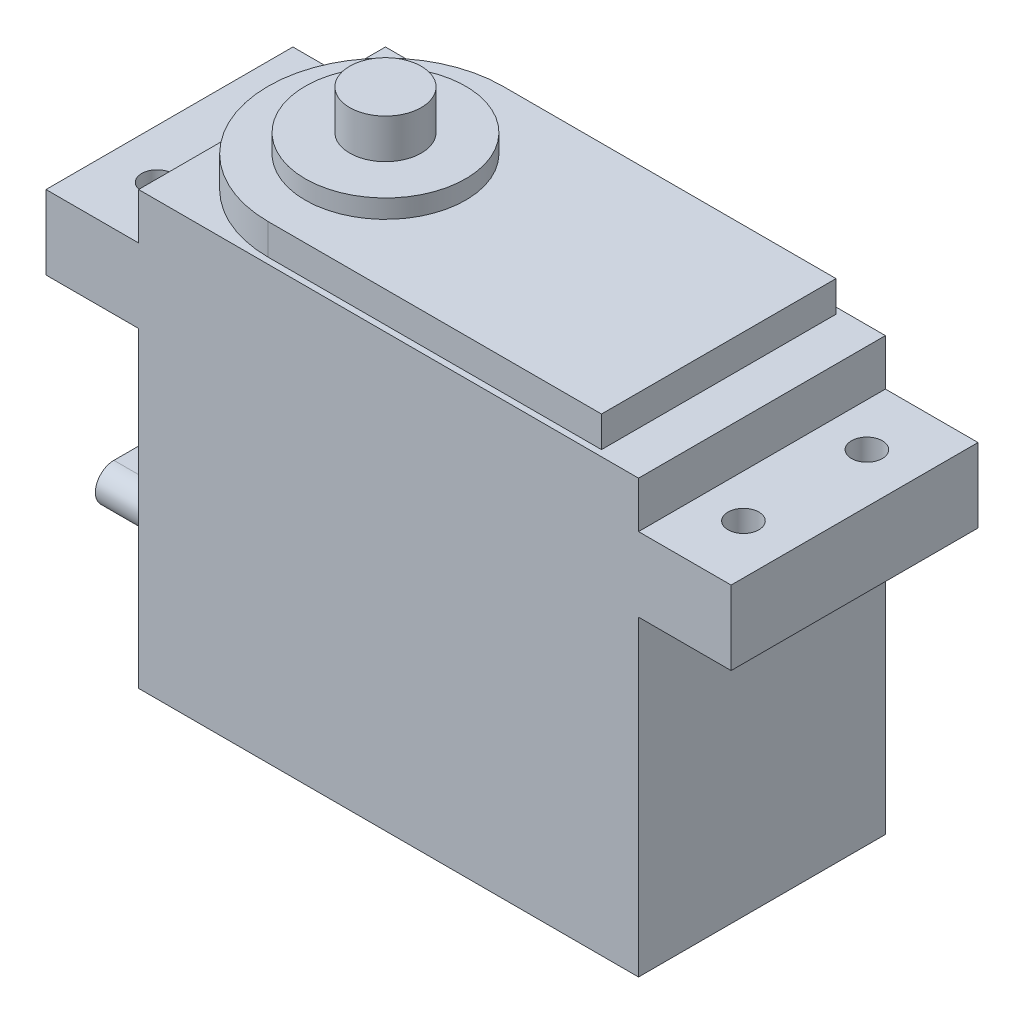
ISO-10303-21;
HEADER;
FILE_DESCRIPTION(('STEP AP214'),'2;1');
FILE_NAME('part.step','',(''),(''),'','','');
FILE_SCHEMA(('AUTOMOTIVE_DESIGN { 1 0 10303 214 1 1 1 1 }'));
ENDSEC;
DATA;
#1=APPLICATION_CONTEXT('core data for automotive mechanical design processes');
#2=APPLICATION_PROTOCOL_DEFINITION('international standard','automotive_design',2000,#1);
#3=PRODUCT_CONTEXT('',#1,'mechanical');
#4=PRODUCT('Part','Part','',(#3));
#5=PRODUCT_RELATED_PRODUCT_CATEGORY('part','',(#4));
#6=PRODUCT_DEFINITION_FORMATION('','',#4);
#7=PRODUCT_DEFINITION_CONTEXT('part definition',#1,'design');
#8=PRODUCT_DEFINITION('design','',#6,#7);
#9=PRODUCT_DEFINITION_SHAPE('','',#8);
#10=(LENGTH_UNIT() NAMED_UNIT(*) SI_UNIT(.MILLI.,.METRE.));
#11=(NAMED_UNIT(*) PLANE_ANGLE_UNIT() SI_UNIT($,.RADIAN.));
#12=(NAMED_UNIT(*) SI_UNIT($,.STERADIAN.) SOLID_ANGLE_UNIT());
#13=UNCERTAINTY_MEASURE_WITH_UNIT(LENGTH_MEASURE(1.E-05),#10,'distance_accuracy_value','');
#14=(GEOMETRIC_REPRESENTATION_CONTEXT(3) GLOBAL_UNCERTAINTY_ASSIGNED_CONTEXT((#13)) GLOBAL_UNIT_ASSIGNED_CONTEXT((#10,
#11,#12)) REPRESENTATION_CONTEXT('',''));
#15=CARTESIAN_POINT('',(0.,0.,0.));
#16=DIRECTION('',(0.,0.,1.));
#17=DIRECTION('',(1.,0.,0.));
#18=AXIS2_PLACEMENT_3D('',#15,#16,#17);
#19=CARTESIAN_POINT('',(-0.5,5.,8.50000000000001));
#20=DIRECTION('',(-1.,0.,0.));
#21=DIRECTION('',(0.,0.,1.));
#22=AXIS2_PLACEMENT_3D('',#19,#20,#21);
#23=PLANE('',#22);
#24=CARTESIAN_POINT('',(-0.5,5.,8.50000000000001));
#25=DIRECTION('',(-1.,0.,0.));
#26=DIRECTION('',(0.,0.,1.));
#27=AXIS2_PLACEMENT_3D('',#24,#25,#26);
#28=CIRCLE('',#27,2.);
#29=CARTESIAN_POINT('',(-0.5,7.,8.50000000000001));
#30=VERTEX_POINT('',#29);
#31=CARTESIAN_POINT('',(-0.5,3.,8.50000000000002));
#32=VERTEX_POINT('',#31);
#33=EDGE_CURVE('E229',#30,#32,#28,.T.);
#34=ORIENTED_EDGE('',*,*,#33,.T.);
#35=DIRECTION('',(0.,0.,1.));
#36=VECTOR('',#35,1.);
#37=CARTESIAN_POINT('',(-0.5,3.,11.5));
#38=LINE('',#37,#36);
#39=CARTESIAN_POINT('',(-0.5,3.,11.5));
#40=VERTEX_POINT('',#39);
#41=EDGE_CURVE('E232',#32,#40,#38,.T.);
#42=ORIENTED_EDGE('',*,*,#41,.T.);
#43=CARTESIAN_POINT('',(-0.5,5.,11.5));
#44=DIRECTION('',(-1.,0.,0.));
#45=DIRECTION('',(0.,0.,-1.));
#46=AXIS2_PLACEMENT_3D('',#43,#44,#45);
#47=CIRCLE('',#46,2.);
#48=CARTESIAN_POINT('',(-0.5,7.,11.5));
#49=VERTEX_POINT('',#48);
#50=EDGE_CURVE('E235',#40,#49,#47,.T.);
#51=ORIENTED_EDGE('',*,*,#50,.T.);
#52=DIRECTION('',(0.,0.,-1.));
#53=VECTOR('',#52,1.);
#54=CARTESIAN_POINT('',(-0.5,7.,8.50000000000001));
#55=LINE('',#54,#53);
#56=EDGE_CURVE('E237',#49,#30,#55,.T.);
#57=ORIENTED_EDGE('',*,*,#56,.T.);
#58=EDGE_LOOP('',(#34,#42,#51,#57));
#59=FACE_BOUND('',#58,.T.);
#60=DIRECTION('',(0.,0.,1.));
#61=VECTOR('',#60,1.);
#62=CARTESIAN_POINT('',(-0.5,3.5,8.50000000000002));
#63=LINE('',#62,#61);
#64=CARTESIAN_POINT('',(-0.5,3.5,8.50000000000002));
#65=VERTEX_POINT('',#64);
#66=CARTESIAN_POINT('',(-0.5,3.5,11.5));
#67=VERTEX_POINT('',#66);
#68=EDGE_CURVE('E798',#65,#67,#63,.T.);
#69=ORIENTED_EDGE('',*,*,#68,.F.);
#70=CARTESIAN_POINT('',(-0.5,5.,8.50000000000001));
#71=DIRECTION('',(-1.,0.,0.));
#72=DIRECTION('',(0.,0.,1.));
#73=AXIS2_PLACEMENT_3D('',#70,#71,#72);
#74=CIRCLE('',#73,1.5);
#75=CARTESIAN_POINT('',(-0.5,6.5,8.50000000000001));
#76=VERTEX_POINT('',#75);
#77=EDGE_CURVE('E220',#76,#65,#74,.T.);
#78=ORIENTED_EDGE('',*,*,#77,.F.);
#79=DIRECTION('',(0.,0.,-1.));
#80=VECTOR('',#79,1.);
#81=CARTESIAN_POINT('',(-0.5,6.5,11.5));
#82=LINE('',#81,#80);
#83=CARTESIAN_POINT('',(-0.5,6.5,11.5));
#84=VERTEX_POINT('',#83);
#85=EDGE_CURVE('E216',#84,#76,#82,.T.);
#86=ORIENTED_EDGE('',*,*,#85,.F.);
#87=CARTESIAN_POINT('',(-0.5,5.,11.5));
#88=DIRECTION('',(-1.,0.,0.));
#89=DIRECTION('',(0.,0.,1.));
#90=AXIS2_PLACEMENT_3D('',#87,#88,#89);
#91=CIRCLE('',#90,1.5);
#92=EDGE_CURVE('E795',#67,#84,#91,.T.);
#93=ORIENTED_EDGE('',*,*,#92,.F.);
#94=EDGE_LOOP('',(#69,#78,#86,#93));
#95=FACE_BOUND('',#94,.T.);
#96=ADVANCED_FACE('F34',(#59,#95),#23,.T.);
#97=CARTESIAN_POINT('',(0.,0.,20.));
#98=DIRECTION('',(1.,0.,0.));
#99=DIRECTION('',(0.,0.,-1.));
#100=AXIS2_PLACEMENT_3D('',#97,#98,#99);
#101=PLANE('',#100);
#102=DIRECTION('',(0.,-1.,0.));
#103=VECTOR('',#102,1.);
#104=CARTESIAN_POINT('',(0.,0.,0.));
#105=LINE('',#104,#103);
#106=CARTESIAN_POINT('',(0.,25.25,0.));
#107=VERTEX_POINT('',#106);
#108=CARTESIAN_POINT('',(0.,0.,0.));
#109=VERTEX_POINT('',#108);
#110=EDGE_CURVE('E347',#107,#109,#105,.T.);
#111=ORIENTED_EDGE('',*,*,#110,.T.);
#112=DIRECTION('',(0.,0.,-1.));
#113=VECTOR('',#112,1.);
#114=CARTESIAN_POINT('',(0.,0.,20.));
#115=LINE('',#114,#113);
#116=CARTESIAN_POINT('',(0.,0.,20.));
#117=VERTEX_POINT('',#116);
#118=EDGE_CURVE('E11',#117,#109,#115,.T.);
#119=ORIENTED_EDGE('',*,*,#118,.F.);
#120=DIRECTION('',(0.,-1.,0.));
#121=VECTOR('',#120,1.);
#122=CARTESIAN_POINT('',(0.,0.,20.));
#123=LINE('',#122,#121);
#124=CARTESIAN_POINT('',(0.,25.25,20.));
#125=VERTEX_POINT('',#124);
#126=EDGE_CURVE('E320',#125,#117,#123,.T.);
#127=ORIENTED_EDGE('',*,*,#126,.F.);
#128=DIRECTION('',(0.,0.,-1.));
#129=VECTOR('',#128,1.);
#130=CARTESIAN_POINT('',(0.,25.25,20.));
#131=LINE('',#130,#129);
#132=EDGE_CURVE('E346',#125,#107,#131,.T.);
#133=ORIENTED_EDGE('',*,*,#132,.T.);
#134=EDGE_LOOP('',(#111,#119,#127,#133));
#135=FACE_BOUND('',#134,.T.);
#136=CARTESIAN_POINT('',(0.,5.,8.50000000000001));
#137=DIRECTION('',(-1.,0.,0.));
#138=DIRECTION('',(0.,0.,1.));
#139=AXIS2_PLACEMENT_3D('',#136,#137,#138);
#140=CIRCLE('',#139,2.);
#141=CARTESIAN_POINT('',(0.,7.,8.50000000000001));
#142=VERTEX_POINT('',#141);
#143=CARTESIAN_POINT('',(0.,3.,8.50000000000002));
#144=VERTEX_POINT('',#143);
#145=EDGE_CURVE('E222',#142,#144,#140,.T.);
#146=ORIENTED_EDGE('',*,*,#145,.F.);
#147=DIRECTION('',(0.,0.,-1.));
#148=VECTOR('',#147,1.);
#149=CARTESIAN_POINT('',(0.,7.,8.50000000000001));
#150=LINE('',#149,#148);
#151=CARTESIAN_POINT('',(0.,7.,11.5));
#152=VERTEX_POINT('',#151);
#153=EDGE_CURVE('E233',#152,#142,#150,.T.);
#154=ORIENTED_EDGE('',*,*,#153,.F.);
#155=CARTESIAN_POINT('',(0.,5.,11.5));
#156=DIRECTION('',(-1.,0.,0.));
#157=DIRECTION('',(0.,0.,-1.));
#158=AXIS2_PLACEMENT_3D('',#155,#156,#157);
#159=CIRCLE('',#158,2.);
#160=CARTESIAN_POINT('',(0.,3.,11.5));
#161=VERTEX_POINT('',#160);
#162=EDGE_CURVE('E241',#161,#152,#159,.T.);
#163=ORIENTED_EDGE('',*,*,#162,.F.);
#164=DIRECTION('',(0.,0.,1.));
#165=VECTOR('',#164,1.);
#166=CARTESIAN_POINT('',(0.,3.,11.5));
#167=LINE('',#166,#165);
#168=EDGE_CURVE('E59',#144,#161,#167,.T.);
#169=ORIENTED_EDGE('',*,*,#168,.F.);
#170=EDGE_LOOP('',(#146,#154,#163,#169));
#171=FACE_BOUND('',#170,.T.);
#172=ADVANCED_FACE('F36',(#135,#171),#101,.F.);
#173=CARTESIAN_POINT('',(10.,39.,10.));
#174=DIRECTION('',(0.,1.,0.));
#175=DIRECTION('',(0.,0.,1.));
#176=AXIS2_PLACEMENT_3D('',#173,#174,#175);
#177=PLANE('',#176);
#178=CARTESIAN_POINT('',(10.,39.,10.));
#179=DIRECTION('',(0.,1.,0.));
#180=DIRECTION('',(0.,0.,1.));
#181=AXIS2_PLACEMENT_3D('',#178,#179,#180);
#182=CIRCLE('',#181,6.5);
#183=CARTESIAN_POINT('',(10.,39.,16.5));
#184=VERTEX_POINT('',#183);
#185=EDGE_CURVE('E263',#184,#184,#182,.T.);
#186=ORIENTED_EDGE('',*,*,#185,.T.);
#187=EDGE_LOOP('',(#186));
#188=FACE_BOUND('',#187,.T.);
#189=CARTESIAN_POINT('',(10.,39.,10.));
#190=DIRECTION('',(0.,1.,0.));
#191=DIRECTION('',(0.,0.,1.));
#192=AXIS2_PLACEMENT_3D('',#189,#190,#191);
#193=CIRCLE('',#192,2.9);
#194=CARTESIAN_POINT('',(10.,39.,12.9));
#195=VERTEX_POINT('',#194);
#196=EDGE_CURVE('E256',#195,#195,#193,.T.);
#197=ORIENTED_EDGE('',*,*,#196,.F.);
#198=EDGE_LOOP('',(#197));
#199=FACE_BOUND('',#198,.T.);
#200=ADVANCED_FACE('F430',(#188,#199),#177,.T.);
#201=CARTESIAN_POINT('',(10.,37.5,10.));
#202=DIRECTION('',(0.,1.,0.));
#203=DIRECTION('',(0.,0.,1.));
#204=AXIS2_PLACEMENT_3D('',#201,#202,#203);
#205=PLANE('',#204);
#206=DIRECTION('',(0.,0.,-1.));
#207=VECTOR('',#206,1.);
#208=CARTESIAN_POINT('',(37.,37.5,0.5));
#209=LINE('',#208,#207);
#210=CARTESIAN_POINT('',(37.,37.5,19.5));
#211=VERTEX_POINT('',#210);
#212=CARTESIAN_POINT('',(37.,37.5,0.5));
#213=VERTEX_POINT('',#212);
#214=EDGE_CURVE('E269',#211,#213,#209,.T.);
#215=ORIENTED_EDGE('',*,*,#214,.T.);
#216=DIRECTION('',(-1.,0.,0.));
#217=VECTOR('',#216,1.);
#218=CARTESIAN_POINT('',(10.,37.5,0.5));
#219=LINE('',#218,#217);
#220=CARTESIAN_POINT('',(10.,37.5,0.5));
#221=VERTEX_POINT('',#220);
#222=EDGE_CURVE('E272',#213,#221,#219,.T.);
#223=ORIENTED_EDGE('',*,*,#222,.T.);
#224=CARTESIAN_POINT('',(10.,37.5,10.));
#225=DIRECTION('',(0.,1.,0.));
#226=DIRECTION('',(0.,0.,1.));
#227=AXIS2_PLACEMENT_3D('',#224,#225,#226);
#228=CIRCLE('',#227,9.5);
#229=CARTESIAN_POINT('',(10.,37.5,19.5));
#230=VERTEX_POINT('',#229);
#231=EDGE_CURVE('E275',#221,#230,#228,.T.);
#232=ORIENTED_EDGE('',*,*,#231,.T.);
#233=DIRECTION('',(1.,0.,0.));
#234=VECTOR('',#233,1.);
#235=CARTESIAN_POINT('',(37.,37.5,19.5));
#236=LINE('',#235,#234);
#237=EDGE_CURVE('E277',#230,#211,#236,.T.);
#238=ORIENTED_EDGE('',*,*,#237,.T.);
#239=EDGE_LOOP('',(#215,#223,#232,#238));
#240=FACE_BOUND('',#239,.T.);
#241=CARTESIAN_POINT('',(10.,37.5,10.));
#242=DIRECTION('',(0.,1.,0.));
#243=DIRECTION('',(0.,0.,1.));
#244=AXIS2_PLACEMENT_3D('',#241,#242,#243);
#245=CIRCLE('',#244,6.5);
#246=CARTESIAN_POINT('',(10.,37.5,16.5));
#247=VERTEX_POINT('',#246);
#248=EDGE_CURVE('E260',#247,#247,#245,.T.);
#249=ORIENTED_EDGE('',*,*,#248,.F.);
#250=EDGE_LOOP('',(#249));
#251=FACE_BOUND('',#250,.T.);
#252=ADVANCED_FACE('F463',(#240,#251),#205,.T.);
#253=CARTESIAN_POINT('',(0.,35.,20.));
#254=DIRECTION('',(0.,-1.,0.));
#255=DIRECTION('',(0.,0.,-1.));
#256=AXIS2_PLACEMENT_3D('',#253,#254,#255);
#257=PLANE('',#256);
#258=DIRECTION('',(-1.,0.,0.));
#259=VECTOR('',#258,1.);
#260=CARTESIAN_POINT('',(0.,35.,0.));
#261=LINE('',#260,#259);
#262=CARTESIAN_POINT('',(40.5,35.,0.));
#263=VERTEX_POINT('',#262);
#264=CARTESIAN_POINT('',(0.,35.,0.));
#265=VERTEX_POINT('',#264);
#266=EDGE_CURVE('E362',#263,#265,#261,.T.);
#267=ORIENTED_EDGE('',*,*,#266,.T.);
#268=DIRECTION('',(0.,0.,-1.));
#269=VECTOR('',#268,1.);
#270=CARTESIAN_POINT('',(0.,35.,20.));
#271=LINE('',#270,#269);
#272=CARTESIAN_POINT('',(0.,35.,20.));
#273=VERTEX_POINT('',#272);
#274=EDGE_CURVE('E382',#273,#265,#271,.T.);
#275=ORIENTED_EDGE('',*,*,#274,.F.);
#276=DIRECTION('',(-1.,0.,0.));
#277=VECTOR('',#276,1.);
#278=CARTESIAN_POINT('',(0.,35.,20.));
#279=LINE('',#278,#277);
#280=CARTESIAN_POINT('',(40.5,35.,20.));
#281=VERTEX_POINT('',#280);
#282=EDGE_CURVE('E336',#281,#273,#279,.T.);
#283=ORIENTED_EDGE('',*,*,#282,.F.);
#284=DIRECTION('',(0.,0.,-1.));
#285=VECTOR('',#284,1.);
#286=CARTESIAN_POINT('',(40.5,35.,20.));
#287=LINE('',#286,#285);
#288=EDGE_CURVE('E385',#281,#263,#287,.T.);
#289=ORIENTED_EDGE('',*,*,#288,.T.);
#290=EDGE_LOOP('',(#267,#275,#283,#289));
#291=FACE_BOUND('',#290,.T.);
#292=DIRECTION('',(0.,0.,-1.));
#293=VECTOR('',#292,1.);
#294=CARTESIAN_POINT('',(37.,35.,0.5));
#295=LINE('',#294,#293);
#296=CARTESIAN_POINT('',(37.,35.,19.5));
#297=VERTEX_POINT('',#296);
#298=CARTESIAN_POINT('',(37.,35.,0.5));
#299=VERTEX_POINT('',#298);
#300=EDGE_CURVE('E266',#297,#299,#295,.T.);
#301=ORIENTED_EDGE('',*,*,#300,.F.);
#302=DIRECTION('',(1.,0.,0.));
#303=VECTOR('',#302,1.);
#304=CARTESIAN_POINT('',(37.,35.,19.5));
#305=LINE('',#304,#303);
#306=CARTESIAN_POINT('',(10.,35.,19.5));
#307=VERTEX_POINT('',#306);
#308=EDGE_CURVE('E273',#307,#297,#305,.T.);
#309=ORIENTED_EDGE('',*,*,#308,.F.);
#310=CARTESIAN_POINT('',(10.,35.,10.));
#311=DIRECTION('',(0.,1.,0.));
#312=DIRECTION('',(0.,0.,1.));
#313=AXIS2_PLACEMENT_3D('',#310,#311,#312);
#314=CIRCLE('',#313,9.5);
#315=CARTESIAN_POINT('',(10.,35.,0.5));
#316=VERTEX_POINT('',#315);
#317=EDGE_CURVE('E285',#316,#307,#314,.T.);
#318=ORIENTED_EDGE('',*,*,#317,.F.);
#319=DIRECTION('',(-1.,0.,0.));
#320=VECTOR('',#319,1.);
#321=CARTESIAN_POINT('',(10.,35.,0.5));
#322=LINE('',#321,#320);
#323=EDGE_CURVE('E282',#299,#316,#322,.T.);
#324=ORIENTED_EDGE('',*,*,#323,.F.);
#325=EDGE_LOOP('',(#301,#309,#318,#324));
#326=FACE_BOUND('',#325,.T.);
#327=ADVANCED_FACE('F471',(#291,#326),#257,.F.);
#328=CARTESIAN_POINT('',(0.,0.,20.));
#329=DIRECTION('',(0.,1.,0.));
#330=DIRECTION('',(0.,0.,1.));
#331=AXIS2_PLACEMENT_3D('',#328,#329,#330);
#332=PLANE('',#331);
#333=DIRECTION('',(1.,0.,0.));
#334=VECTOR('',#333,1.);
#335=CARTESIAN_POINT('',(0.,0.,0.));
#336=LINE('',#335,#334);
#337=CARTESIAN_POINT('',(40.5,0.,0.));
#338=VERTEX_POINT('',#337);
#339=EDGE_CURVE('E350',#109,#338,#336,.T.);
#340=ORIENTED_EDGE('',*,*,#339,.T.);
#341=DIRECTION('',(0.,0.,-1.));
#342=VECTOR('',#341,1.);
#343=CARTESIAN_POINT('',(40.5,0.,20.));
#344=LINE('',#343,#342);
#345=CARTESIAN_POINT('',(40.5,0.,20.));
#346=VERTEX_POINT('',#345);
#347=EDGE_CURVE('E43',#346,#338,#344,.T.);
#348=ORIENTED_EDGE('',*,*,#347,.F.);
#349=DIRECTION('',(1.,0.,0.));
#350=VECTOR('',#349,1.);
#351=CARTESIAN_POINT('',(0.,0.,20.));
#352=LINE('',#351,#350);
#353=EDGE_CURVE('E323',#117,#346,#352,.T.);
#354=ORIENTED_EDGE('',*,*,#353,.F.);
#355=ORIENTED_EDGE('',*,*,#118,.T.);
#356=EDGE_LOOP('',(#340,#348,#354,#355));
#357=FACE_BOUND('',#356,.T.);
#358=ADVANCED_FACE('F537',(#357),#332,.F.);
#359=CARTESIAN_POINT('',(40.5,0.,20.));
#360=DIRECTION('',(-1.,0.,0.));
#361=DIRECTION('',(0.,0.,1.));
#362=AXIS2_PLACEMENT_3D('',#359,#360,#361);
#363=PLANE('',#362);
#364=DIRECTION('',(0.,1.,0.));
#365=VECTOR('',#364,1.);
#366=CARTESIAN_POINT('',(40.5,0.,0.));
#367=LINE('',#366,#365);
#368=CARTESIAN_POINT('',(40.5,25.25,0.));
#369=VERTEX_POINT('',#368);
#370=EDGE_CURVE('E352',#338,#369,#367,.T.);
#371=ORIENTED_EDGE('',*,*,#370,.T.);
#372=DIRECTION('',(0.,0.,-1.));
#373=VECTOR('',#372,1.);
#374=CARTESIAN_POINT('',(40.5,25.25,20.));
#375=LINE('',#374,#373);
#376=CARTESIAN_POINT('',(40.5,25.25,20.));
#377=VERTEX_POINT('',#376);
#378=EDGE_CURVE('E397',#377,#369,#375,.T.);
#379=ORIENTED_EDGE('',*,*,#378,.F.);
#380=DIRECTION('',(0.,1.,0.));
#381=VECTOR('',#380,1.);
#382=CARTESIAN_POINT('',(40.5,0.,20.));
#383=LINE('',#382,#381);
#384=EDGE_CURVE('E326',#346,#377,#383,.T.);
#385=ORIENTED_EDGE('',*,*,#384,.F.);
#386=ORIENTED_EDGE('',*,*,#347,.T.);
#387=EDGE_LOOP('',(#371,#379,#385,#386));
#388=FACE_BOUND('',#387,.T.);
#389=ADVANCED_FACE('F504',(#388),#363,.F.);
#390=CARTESIAN_POINT('',(40.5,25.25,20.));
#391=DIRECTION('',(0.,1.,0.));
#392=DIRECTION('',(0.,0.,1.));
#393=AXIS2_PLACEMENT_3D('',#390,#391,#392);
#394=PLANE('',#393);
#395=CARTESIAN_POINT('',(44.,25.25,5.));
#396=DIRECTION('',(0.,1.,0.));
#397=DIRECTION('',(0.,0.,1.));
#398=AXIS2_PLACEMENT_3D('',#395,#396,#397);
#399=CIRCLE('',#398,1.25);
#400=CARTESIAN_POINT('',(44.,25.25,6.25));
#401=VERTEX_POINT('',#400);
#402=EDGE_CURVE('E304',#401,#401,#399,.T.);
#403=ORIENTED_EDGE('',*,*,#402,.T.);
#404=EDGE_LOOP('',(#403));
#405=FACE_BOUND('',#404,.T.);
#406=CARTESIAN_POINT('',(44.,25.25,15.));
#407=DIRECTION('',(0.,1.,0.));
#408=DIRECTION('',(0.,0.,1.));
#409=AXIS2_PLACEMENT_3D('',#406,#407,#408);
#410=CIRCLE('',#409,1.25);
#411=CARTESIAN_POINT('',(44.,25.25,16.25));
#412=VERTEX_POINT('',#411);
#413=EDGE_CURVE('E310',#412,#412,#410,.T.);
#414=ORIENTED_EDGE('',*,*,#413,.T.);
#415=EDGE_LOOP('',(#414));
#416=FACE_BOUND('',#415,.T.);
#417=DIRECTION('',(1.,0.,0.));
#418=VECTOR('',#417,1.);
#419=CARTESIAN_POINT('',(40.5,25.25,0.));
#420=LINE('',#419,#418);
#421=CARTESIAN_POINT('',(48.,25.25,0.));
#422=VERTEX_POINT('',#421);
#423=EDGE_CURVE('E354',#369,#422,#420,.T.);
#424=ORIENTED_EDGE('',*,*,#423,.T.);
#425=DIRECTION('',(0.,0.,-1.));
#426=VECTOR('',#425,1.);
#427=CARTESIAN_POINT('',(48.,25.25,20.));
#428=LINE('',#427,#426);
#429=CARTESIAN_POINT('',(48.,25.25,20.));
#430=VERTEX_POINT('',#429);
#431=EDGE_CURVE('E394',#430,#422,#428,.T.);
#432=ORIENTED_EDGE('',*,*,#431,.F.);
#433=DIRECTION('',(1.,0.,0.));
#434=VECTOR('',#433,1.);
#435=CARTESIAN_POINT('',(40.5,25.25,20.));
#436=LINE('',#435,#434);
#437=EDGE_CURVE('E328',#377,#430,#436,.T.);
#438=ORIENTED_EDGE('',*,*,#437,.F.);
#439=ORIENTED_EDGE('',*,*,#378,.T.);
#440=EDGE_LOOP('',(#424,#432,#438,#439));
#441=FACE_BOUND('',#440,.T.);
#442=ADVANCED_FACE('F500',(#405,#416,#441),#394,.F.);
#443=CARTESIAN_POINT('',(48.,25.25,20.));
#444=DIRECTION('',(-1.,0.,0.));
#445=DIRECTION('',(0.,0.,1.));
#446=AXIS2_PLACEMENT_3D('',#443,#444,#445);
#447=PLANE('',#446);
#448=DIRECTION('',(0.,1.,0.));
#449=VECTOR('',#448,1.);
#450=CARTESIAN_POINT('',(48.,25.25,0.));
#451=LINE('',#450,#449);
#452=CARTESIAN_POINT('',(48.,31.25,0.));
#453=VERTEX_POINT('',#452);
#454=EDGE_CURVE('E356',#422,#453,#451,.T.);
#455=ORIENTED_EDGE('',*,*,#454,.T.);
#456=DIRECTION('',(0.,0.,-1.));
#457=VECTOR('',#456,1.);
#458=CARTESIAN_POINT('',(48.,31.25,20.));
#459=LINE('',#458,#457);
#460=CARTESIAN_POINT('',(48.,31.25,20.));
#461=VERTEX_POINT('',#460);
#462=EDGE_CURVE('E391',#461,#453,#459,.T.);
#463=ORIENTED_EDGE('',*,*,#462,.F.);
#464=DIRECTION('',(0.,1.,0.));
#465=VECTOR('',#464,1.);
#466=CARTESIAN_POINT('',(48.,25.25,20.));
#467=LINE('',#466,#465);
#468=EDGE_CURVE('E330',#430,#461,#467,.T.);
#469=ORIENTED_EDGE('',*,*,#468,.F.);
#470=ORIENTED_EDGE('',*,*,#431,.T.);
#471=EDGE_LOOP('',(#455,#463,#469,#470));
#472=FACE_BOUND('',#471,.T.);
#473=ADVANCED_FACE('F503',(#472),#447,.F.);
#474=CARTESIAN_POINT('',(48.,31.25,20.));
#475=DIRECTION('',(0.,-1.,0.));
#476=DIRECTION('',(0.,0.,-1.));
#477=AXIS2_PLACEMENT_3D('',#474,#475,#476);
#478=PLANE('',#477);
#479=CARTESIAN_POINT('',(44.,31.25,5.));
#480=DIRECTION('',(0.,1.,0.));
#481=DIRECTION('',(0.,0.,1.));
#482=AXIS2_PLACEMENT_3D('',#479,#480,#481);
#483=CIRCLE('',#482,1.25);
#484=CARTESIAN_POINT('',(44.,31.25,6.25));
#485=VERTEX_POINT('',#484);
#486=EDGE_CURVE('E301',#485,#485,#483,.T.);
#487=ORIENTED_EDGE('',*,*,#486,.F.);
#488=EDGE_LOOP('',(#487));
#489=FACE_BOUND('',#488,.T.);
#490=CARTESIAN_POINT('',(44.,31.25,15.));
#491=DIRECTION('',(0.,1.,0.));
#492=DIRECTION('',(0.,0.,1.));
#493=AXIS2_PLACEMENT_3D('',#490,#491,#492);
#494=CIRCLE('',#493,1.25);
#495=CARTESIAN_POINT('',(44.,31.25,16.25));
#496=VERTEX_POINT('',#495);
#497=EDGE_CURVE('E307',#496,#496,#494,.T.);
#498=ORIENTED_EDGE('',*,*,#497,.F.);
#499=EDGE_LOOP('',(#498));
#500=FACE_BOUND('',#499,.T.);
#501=DIRECTION('',(-1.,0.,0.));
#502=VECTOR('',#501,1.);
#503=CARTESIAN_POINT('',(48.,31.25,0.));
#504=LINE('',#503,#502);
#505=CARTESIAN_POINT('',(40.5,31.25,0.));
#506=VERTEX_POINT('',#505);
#507=EDGE_CURVE('E358',#453,#506,#504,.T.);
#508=ORIENTED_EDGE('',*,*,#507,.T.);
#509=DIRECTION('',(0.,0.,-1.));
#510=VECTOR('',#509,1.);
#511=CARTESIAN_POINT('',(40.5,31.25,20.));
#512=LINE('',#511,#510);
#513=CARTESIAN_POINT('',(40.5,31.25,20.));
#514=VERTEX_POINT('',#513);
#515=EDGE_CURVE('E388',#514,#506,#512,.T.);
#516=ORIENTED_EDGE('',*,*,#515,.F.);
#517=DIRECTION('',(-1.,0.,0.));
#518=VECTOR('',#517,1.);
#519=CARTESIAN_POINT('',(48.,31.25,20.));
#520=LINE('',#519,#518);
#521=EDGE_CURVE('E332',#461,#514,#520,.T.);
#522=ORIENTED_EDGE('',*,*,#521,.F.);
#523=ORIENTED_EDGE('',*,*,#462,.T.);
#524=EDGE_LOOP('',(#508,#516,#522,#523));
#525=FACE_BOUND('',#524,.T.);
#526=ADVANCED_FACE('F522',(#489,#500,#525),#478,.F.);
#527=CARTESIAN_POINT('',(40.5,31.25,20.));
#528=DIRECTION('',(-1.,0.,0.));
#529=DIRECTION('',(0.,0.,1.));
#530=AXIS2_PLACEMENT_3D('',#527,#528,#529);
#531=PLANE('',#530);
#532=DIRECTION('',(0.,1.,0.));
#533=VECTOR('',#532,1.);
#534=CARTESIAN_POINT('',(40.5,31.25,0.));
#535=LINE('',#534,#533);
#536=EDGE_CURVE('E360',#506,#263,#535,.T.);
#537=ORIENTED_EDGE('',*,*,#536,.T.);
#538=ORIENTED_EDGE('',*,*,#288,.F.);
#539=DIRECTION('',(0.,1.,0.));
#540=VECTOR('',#539,1.);
#541=CARTESIAN_POINT('',(40.5,31.25,20.));
#542=LINE('',#541,#540);
#543=EDGE_CURVE('E334',#514,#281,#542,.T.);
#544=ORIENTED_EDGE('',*,*,#543,.F.);
#545=ORIENTED_EDGE('',*,*,#515,.T.);
#546=EDGE_LOOP('',(#537,#538,#544,#545));
#547=FACE_BOUND('',#546,.T.);
#548=ADVANCED_FACE('F526',(#547),#531,.F.);
#549=CARTESIAN_POINT('',(0.,31.25,20.));
#550=DIRECTION('',(1.,0.,0.));
#551=DIRECTION('',(0.,0.,-1.));
#552=AXIS2_PLACEMENT_3D('',#549,#550,#551);
#553=PLANE('',#552);
#554=DIRECTION('',(0.,-1.,0.));
#555=VECTOR('',#554,1.);
#556=CARTESIAN_POINT('',(0.,31.25,0.));
#557=LINE('',#556,#555);
#558=CARTESIAN_POINT('',(0.,31.25,0.));
#559=VERTEX_POINT('',#558);
#560=EDGE_CURVE('E364',#265,#559,#557,.T.);
#561=ORIENTED_EDGE('',*,*,#560,.T.);
#562=DIRECTION('',(0.,0.,-1.));
#563=VECTOR('',#562,1.);
#564=CARTESIAN_POINT('',(0.,31.25,20.));
#565=LINE('',#564,#563);
#566=CARTESIAN_POINT('',(0.,31.25,20.));
#567=VERTEX_POINT('',#566);
#568=EDGE_CURVE('E379',#567,#559,#565,.T.);
#569=ORIENTED_EDGE('',*,*,#568,.F.);
#570=DIRECTION('',(0.,-1.,0.));
#571=VECTOR('',#570,1.);
#572=CARTESIAN_POINT('',(0.,31.25,20.));
#573=LINE('',#572,#571);
#574=EDGE_CURVE('E338',#273,#567,#573,.T.);
#575=ORIENTED_EDGE('',*,*,#574,.F.);
#576=ORIENTED_EDGE('',*,*,#274,.T.);
#577=EDGE_LOOP('',(#561,#569,#575,#576));
#578=FACE_BOUND('',#577,.T.);
#579=ADVANCED_FACE('F555',(#578),#553,.F.);
#580=CARTESIAN_POINT('',(0.,31.25,20.));
#581=DIRECTION('',(0.,-1.,0.));
#582=DIRECTION('',(0.,0.,-1.));
#583=AXIS2_PLACEMENT_3D('',#580,#581,#582);
#584=PLANE('',#583);
#585=CARTESIAN_POINT('',(-3.5,31.25,15.));
#586=DIRECTION('',(0.,1.,0.));
#587=DIRECTION('',(0.,0.,1.));
#588=AXIS2_PLACEMENT_3D('',#585,#586,#587);
#589=CIRCLE('',#588,1.25);
#590=CARTESIAN_POINT('',(-3.5,31.25,16.25));
#591=VERTEX_POINT('',#590);
#592=EDGE_CURVE('E313',#591,#591,#589,.T.);
#593=ORIENTED_EDGE('',*,*,#592,.F.);
#594=EDGE_LOOP('',(#593));
#595=FACE_BOUND('',#594,.T.);
#596=CARTESIAN_POINT('',(-3.5,31.25,5.));
#597=DIRECTION('',(0.,1.,0.));
#598=DIRECTION('',(0.,0.,1.));
#599=AXIS2_PLACEMENT_3D('',#596,#597,#598);
#600=CIRCLE('',#599,1.25);
#601=CARTESIAN_POINT('',(-3.5,31.25,6.25));
#602=VERTEX_POINT('',#601);
#603=EDGE_CURVE('E316',#602,#602,#600,.T.);
#604=ORIENTED_EDGE('',*,*,#603,.F.);
#605=EDGE_LOOP('',(#604));
#606=FACE_BOUND('',#605,.T.);
#607=DIRECTION('',(-1.,0.,0.));
#608=VECTOR('',#607,1.);
#609=CARTESIAN_POINT('',(0.,31.25,0.));
#610=LINE('',#609,#608);
#611=CARTESIAN_POINT('',(-7.5,31.25,0.));
#612=VERTEX_POINT('',#611);
#613=EDGE_CURVE('E366',#559,#612,#610,.T.);
#614=ORIENTED_EDGE('',*,*,#613,.T.);
#615=DIRECTION('',(0.,0.,-1.));
#616=VECTOR('',#615,1.);
#617=CARTESIAN_POINT('',(-7.5,31.25,20.));
#618=LINE('',#617,#616);
#619=CARTESIAN_POINT('',(-7.5,31.25,20.));
#620=VERTEX_POINT('',#619);
#621=EDGE_CURVE('E376',#620,#612,#618,.T.);
#622=ORIENTED_EDGE('',*,*,#621,.F.);
#623=DIRECTION('',(-1.,0.,0.));
#624=VECTOR('',#623,1.);
#625=CARTESIAN_POINT('',(0.,31.25,20.));
#626=LINE('',#625,#624);
#627=EDGE_CURVE('E340',#567,#620,#626,.T.);
#628=ORIENTED_EDGE('',*,*,#627,.F.);
#629=ORIENTED_EDGE('',*,*,#568,.T.);
#630=EDGE_LOOP('',(#614,#622,#628,#629));
#631=FACE_BOUND('',#630,.T.);
#632=ADVANCED_FACE('F551',(#595,#606,#631),#584,.F.);
#633=CARTESIAN_POINT('',(-7.5,25.25,20.));
#634=DIRECTION('',(1.,0.,0.));
#635=DIRECTION('',(0.,0.,-1.));
#636=AXIS2_PLACEMENT_3D('',#633,#634,#635);
#637=PLANE('',#636);
#638=DIRECTION('',(0.,-1.,0.));
#639=VECTOR('',#638,1.);
#640=CARTESIAN_POINT('',(-7.5,25.25,0.));
#641=LINE('',#640,#639);
#642=CARTESIAN_POINT('',(-7.5,25.25,0.));
#643=VERTEX_POINT('',#642);
#644=EDGE_CURVE('E368',#612,#643,#641,.T.);
#645=ORIENTED_EDGE('',*,*,#644,.T.);
#646=DIRECTION('',(0.,0.,-1.));
#647=VECTOR('',#646,1.);
#648=CARTESIAN_POINT('',(-7.5,25.25,20.));
#649=LINE('',#648,#647);
#650=CARTESIAN_POINT('',(-7.5,25.25,20.));
#651=VERTEX_POINT('',#650);
#652=EDGE_CURVE('E373',#651,#643,#649,.T.);
#653=ORIENTED_EDGE('',*,*,#652,.F.);
#654=DIRECTION('',(0.,-1.,0.));
#655=VECTOR('',#654,1.);
#656=CARTESIAN_POINT('',(-7.5,25.25,20.));
#657=LINE('',#656,#655);
#658=EDGE_CURVE('E342',#620,#651,#657,.T.);
#659=ORIENTED_EDGE('',*,*,#658,.F.);
#660=ORIENTED_EDGE('',*,*,#621,.T.);
#661=EDGE_LOOP('',(#645,#653,#659,#660));
#662=FACE_BOUND('',#661,.T.);
#663=ADVANCED_FACE('F546',(#662),#637,.F.);
#664=CARTESIAN_POINT('',(-7.5,25.25,20.));
#665=DIRECTION('',(0.,1.,0.));
#666=DIRECTION('',(0.,0.,1.));
#667=AXIS2_PLACEMENT_3D('',#664,#665,#666);
#668=PLANE('',#667);
#669=CARTESIAN_POINT('',(-3.5,25.25,15.));
#670=DIRECTION('',(0.,1.,0.));
#671=DIRECTION('',(0.,0.,1.));
#672=AXIS2_PLACEMENT_3D('',#669,#670,#671);
#673=CIRCLE('',#672,1.25);
#674=CARTESIAN_POINT('',(-3.5,25.25,16.25));
#675=VERTEX_POINT('',#674);
#676=EDGE_CURVE('E38',#675,#675,#673,.T.);
#677=ORIENTED_EDGE('',*,*,#676,.T.);
#678=EDGE_LOOP('',(#677));
#679=FACE_BOUND('',#678,.T.);
#680=CARTESIAN_POINT('',(-3.5,25.25,5.));
#681=DIRECTION('',(0.,1.,0.));
#682=DIRECTION('',(0.,0.,1.));
#683=AXIS2_PLACEMENT_3D('',#680,#681,#682);
#684=CIRCLE('',#683,1.25);
#685=CARTESIAN_POINT('',(-3.5,25.25,6.25));
#686=VERTEX_POINT('',#685);
#687=EDGE_CURVE('E319',#686,#686,#684,.T.);
#688=ORIENTED_EDGE('',*,*,#687,.T.);
#689=EDGE_LOOP('',(#688));
#690=FACE_BOUND('',#689,.T.);
#691=DIRECTION('',(1.,0.,0.));
#692=VECTOR('',#691,1.);
#693=CARTESIAN_POINT('',(-7.5,25.25,0.));
#694=LINE('',#693,#692);
#695=EDGE_CURVE('E324',#643,#107,#694,.T.);
#696=ORIENTED_EDGE('',*,*,#695,.T.);
#697=ORIENTED_EDGE('',*,*,#132,.F.);
#698=DIRECTION('',(1.,0.,0.));
#699=VECTOR('',#698,1.);
#700=CARTESIAN_POINT('',(-7.5,25.25,20.));
#701=LINE('',#700,#699);
#702=EDGE_CURVE('E344',#651,#125,#701,.T.);
#703=ORIENTED_EDGE('',*,*,#702,.F.);
#704=ORIENTED_EDGE('',*,*,#652,.T.);
#705=EDGE_LOOP('',(#696,#697,#703,#704));
#706=FACE_BOUND('',#705,.T.);
#707=ADVANCED_FACE('F404',(#679,#690,#706),#668,.F.);
#708=CARTESIAN_POINT('',(0.,25.25,20.));
#709=DIRECTION('',(0.,0.,-1.));
#710=DIRECTION('',(-1.,0.,0.));
#711=AXIS2_PLACEMENT_3D('',#708,#709,#710);
#712=PLANE('',#711);
#713=ORIENTED_EDGE('',*,*,#126,.T.);
#714=ORIENTED_EDGE('',*,*,#353,.T.);
#715=ORIENTED_EDGE('',*,*,#384,.T.);
#716=ORIENTED_EDGE('',*,*,#437,.T.);
#717=ORIENTED_EDGE('',*,*,#468,.T.);
#718=ORIENTED_EDGE('',*,*,#521,.T.);
#719=ORIENTED_EDGE('',*,*,#543,.T.);
#720=ORIENTED_EDGE('',*,*,#282,.T.);
#721=ORIENTED_EDGE('',*,*,#574,.T.);
#722=ORIENTED_EDGE('',*,*,#627,.T.);
#723=ORIENTED_EDGE('',*,*,#658,.T.);
#724=ORIENTED_EDGE('',*,*,#702,.T.);
#725=EDGE_LOOP('',(#713,#714,#715,#716,#717,#718,#719,#720,#721,#722,#723,#724));
#726=FACE_BOUND('',#725,.T.);
#727=ADVANCED_FACE('F420',(#726),#712,.F.);
#728=CARTESIAN_POINT('',(0.,25.25,0.));
#729=DIRECTION('',(0.,0.,-1.));
#730=DIRECTION('',(-1.,0.,0.));
#731=AXIS2_PLACEMENT_3D('',#728,#729,#730);
#732=PLANE('',#731);
#733=ORIENTED_EDGE('',*,*,#110,.F.);
#734=ORIENTED_EDGE('',*,*,#695,.F.);
#735=ORIENTED_EDGE('',*,*,#644,.F.);
#736=ORIENTED_EDGE('',*,*,#613,.F.);
#737=ORIENTED_EDGE('',*,*,#560,.F.);
#738=ORIENTED_EDGE('',*,*,#266,.F.);
#739=ORIENTED_EDGE('',*,*,#536,.F.);
#740=ORIENTED_EDGE('',*,*,#507,.F.);
#741=ORIENTED_EDGE('',*,*,#454,.F.);
#742=ORIENTED_EDGE('',*,*,#423,.F.);
#743=ORIENTED_EDGE('',*,*,#370,.F.);
#744=ORIENTED_EDGE('',*,*,#339,.F.);
#745=EDGE_LOOP('',(#733,#734,#735,#736,#737,#738,#739,#740,#741,#742,#743,#744));
#746=FACE_BOUND('',#745,.T.);
#747=ADVANCED_FACE('F410',(#746),#732,.T.);
#748=CARTESIAN_POINT('',(-3.5,0.,5.));
#749=DIRECTION('',(0.,1.,0.));
#750=DIRECTION('',(0.,0.,1.));
#751=AXIS2_PLACEMENT_3D('',#748,#749,#750);
#752=CYLINDRICAL_SURFACE('',#751,1.25);
#753=ORIENTED_EDGE('',*,*,#603,.T.);
#754=EDGE_LOOP('',(#753));
#755=FACE_BOUND('',#754,.T.);
#756=ORIENTED_EDGE('',*,*,#687,.F.);
#757=EDGE_LOOP('',(#756));
#758=FACE_BOUND('',#757,.T.);
#759=ADVANCED_FACE('F407',(#755,#758),#752,.F.);
#760=CARTESIAN_POINT('',(-3.5,0.,15.));
#761=DIRECTION('',(0.,1.,0.));
#762=DIRECTION('',(0.,0.,1.));
#763=AXIS2_PLACEMENT_3D('',#760,#761,#762);
#764=CYLINDRICAL_SURFACE('',#763,1.25);
#765=ORIENTED_EDGE('',*,*,#592,.T.);
#766=EDGE_LOOP('',(#765));
#767=FACE_BOUND('',#766,.T.);
#768=ORIENTED_EDGE('',*,*,#676,.F.);
#769=EDGE_LOOP('',(#768));
#770=FACE_BOUND('',#769,.T.);
#771=ADVANCED_FACE('F409',(#767,#770),#764,.F.);
#772=CARTESIAN_POINT('',(44.,0.,15.));
#773=DIRECTION('',(0.,1.,0.));
#774=DIRECTION('',(0.,0.,1.));
#775=AXIS2_PLACEMENT_3D('',#772,#773,#774);
#776=CYLINDRICAL_SURFACE('',#775,1.25);
#777=ORIENTED_EDGE('',*,*,#497,.T.);
#778=EDGE_LOOP('',(#777));
#779=FACE_BOUND('',#778,.T.);
#780=ORIENTED_EDGE('',*,*,#413,.F.);
#781=EDGE_LOOP('',(#780));
#782=FACE_BOUND('',#781,.T.);
#783=ADVANCED_FACE('F417',(#779,#782),#776,.F.);
#784=CARTESIAN_POINT('',(44.,0.,5.));
#785=DIRECTION('',(0.,1.,0.));
#786=DIRECTION('',(0.,0.,1.));
#787=AXIS2_PLACEMENT_3D('',#784,#785,#786);
#788=CYLINDRICAL_SURFACE('',#787,1.25);
#789=ORIENTED_EDGE('',*,*,#486,.T.);
#790=EDGE_LOOP('',(#789));
#791=FACE_BOUND('',#790,.T.);
#792=ORIENTED_EDGE('',*,*,#402,.F.);
#793=EDGE_LOOP('',(#792));
#794=FACE_BOUND('',#793,.T.);
#795=ADVANCED_FACE('F487',(#791,#794),#788,.F.);
#796=CARTESIAN_POINT('',(37.,37.5,0.5));
#797=DIRECTION('',(-1.,0.,0.));
#798=DIRECTION('',(0.,0.,1.));
#799=AXIS2_PLACEMENT_3D('',#796,#797,#798);
#800=PLANE('',#799);
#801=ORIENTED_EDGE('',*,*,#300,.T.);
#802=DIRECTION('',(0.,-1.,0.));
#803=VECTOR('',#802,1.);
#804=CARTESIAN_POINT('',(37.,37.5,0.5));
#805=LINE('',#804,#803);
#806=EDGE_CURVE('E298',#213,#299,#805,.T.);
#807=ORIENTED_EDGE('',*,*,#806,.F.);
#808=ORIENTED_EDGE('',*,*,#214,.F.);
#809=DIRECTION('',(0.,-1.,0.));
#810=VECTOR('',#809,1.);
#811=CARTESIAN_POINT('',(37.,37.5,19.5));
#812=LINE('',#811,#810);
#813=EDGE_CURVE('E279',#211,#297,#812,.T.);
#814=ORIENTED_EDGE('',*,*,#813,.T.);
#815=EDGE_LOOP('',(#801,#807,#808,#814));
#816=FACE_BOUND('',#815,.T.);
#817=ADVANCED_FACE('F483',(#816),#800,.F.);
#818=CARTESIAN_POINT('',(10.,37.5,0.5));
#819=DIRECTION('',(0.,0.,1.));
#820=DIRECTION('',(1.,0.,0.));
#821=AXIS2_PLACEMENT_3D('',#818,#819,#820);
#822=PLANE('',#821);
#823=ORIENTED_EDGE('',*,*,#323,.T.);
#824=DIRECTION('',(0.,-1.,0.));
#825=VECTOR('',#824,1.);
#826=CARTESIAN_POINT('',(10.,37.5,0.5));
#827=LINE('',#826,#825);
#828=EDGE_CURVE('E295',#221,#316,#827,.T.);
#829=ORIENTED_EDGE('',*,*,#828,.F.);
#830=ORIENTED_EDGE('',*,*,#222,.F.);
#831=ORIENTED_EDGE('',*,*,#806,.T.);
#832=EDGE_LOOP('',(#823,#829,#830,#831));
#833=FACE_BOUND('',#832,.T.);
#834=ADVANCED_FACE('F479',(#833),#822,.F.);
#835=CARTESIAN_POINT('',(10.,37.5,10.));
#836=DIRECTION('',(0.,-1.,0.));
#837=DIRECTION('',(0.,0.,-1.));
#838=AXIS2_PLACEMENT_3D('',#835,#836,#837);
#839=CYLINDRICAL_SURFACE('',#838,9.5);
#840=ORIENTED_EDGE('',*,*,#317,.T.);
#841=DIRECTION('',(0.,-1.,0.));
#842=VECTOR('',#841,1.);
#843=CARTESIAN_POINT('',(10.,37.5,19.5));
#844=LINE('',#843,#842);
#845=EDGE_CURVE('E292',#230,#307,#844,.T.);
#846=ORIENTED_EDGE('',*,*,#845,.F.);
#847=ORIENTED_EDGE('',*,*,#231,.F.);
#848=ORIENTED_EDGE('',*,*,#828,.T.);
#849=EDGE_LOOP('',(#840,#846,#847,#848));
#850=FACE_BOUND('',#849,.T.);
#851=ADVANCED_FACE('F475',(#850),#839,.T.);
#852=CARTESIAN_POINT('',(37.,37.5,19.5));
#853=DIRECTION('',(0.,0.,-1.));
#854=DIRECTION('',(-1.,0.,0.));
#855=AXIS2_PLACEMENT_3D('',#852,#853,#854);
#856=PLANE('',#855);
#857=ORIENTED_EDGE('',*,*,#308,.T.);
#858=ORIENTED_EDGE('',*,*,#813,.F.);
#859=ORIENTED_EDGE('',*,*,#237,.F.);
#860=ORIENTED_EDGE('',*,*,#845,.T.);
#861=EDGE_LOOP('',(#857,#858,#859,#860));
#862=FACE_BOUND('',#861,.T.);
#863=ADVANCED_FACE('F467',(#862),#856,.F.);
#864=CARTESIAN_POINT('',(10.,39.,10.));
#865=DIRECTION('',(0.,-1.,0.));
#866=DIRECTION('',(0.,0.,-1.));
#867=AXIS2_PLACEMENT_3D('',#864,#865,#866);
#868=CYLINDRICAL_SURFACE('',#867,6.5);
#869=ORIENTED_EDGE('',*,*,#185,.F.);
#870=EDGE_LOOP('',(#869));
#871=FACE_BOUND('',#870,.T.);
#872=ORIENTED_EDGE('',*,*,#248,.T.);
#873=EDGE_LOOP('',(#872));
#874=FACE_BOUND('',#873,.T.);
#875=ADVANCED_FACE('F459',(#871,#874),#868,.T.);
#876=CARTESIAN_POINT('',(10.,42.2,10.));
#877=DIRECTION('',(0.,-1.,0.));
#878=DIRECTION('',(0.,0.,-1.));
#879=AXIS2_PLACEMENT_3D('',#876,#877,#878);
#880=CYLINDRICAL_SURFACE('',#879,2.9);
#881=CARTESIAN_POINT('',(10.,42.2,10.));
#882=DIRECTION('',(0.,1.,0.));
#883=DIRECTION('',(0.,0.,1.));
#884=AXIS2_PLACEMENT_3D('',#881,#882,#883);
#885=CIRCLE('',#884,2.9);
#886=CARTESIAN_POINT('',(10.,42.2,12.9));
#887=VERTEX_POINT('',#886);
#888=EDGE_CURVE('E257',#887,#887,#885,.T.);
#889=ORIENTED_EDGE('',*,*,#888,.F.);
#890=EDGE_LOOP('',(#889));
#891=FACE_BOUND('',#890,.T.);
#892=ORIENTED_EDGE('',*,*,#196,.T.);
#893=EDGE_LOOP('',(#892));
#894=FACE_BOUND('',#893,.T.);
#895=ADVANCED_FACE('F455',(#891,#894),#880,.T.);
#896=CARTESIAN_POINT('',(10.,42.2,10.));
#897=DIRECTION('',(0.,1.,0.));
#898=DIRECTION('',(0.,0.,1.));
#899=AXIS2_PLACEMENT_3D('',#896,#897,#898);
#900=PLANE('',#899);
#901=ORIENTED_EDGE('',*,*,#888,.T.);
#902=EDGE_LOOP('',(#901));
#903=FACE_BOUND('',#902,.T.);
#904=ADVANCED_FACE('F451',(#903),#900,.T.);
#905=CARTESIAN_POINT('',(-0.5,5.,8.50000000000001));
#906=DIRECTION('',(1.,0.,0.));
#907=DIRECTION('',(0.,0.,-1.));
#908=AXIS2_PLACEMENT_3D('',#905,#906,#907);
#909=CYLINDRICAL_SURFACE('',#908,2.);
#910=ORIENTED_EDGE('',*,*,#145,.T.);
#911=DIRECTION('',(1.,0.,0.));
#912=VECTOR('',#911,1.);
#913=CARTESIAN_POINT('',(-0.5,3.,8.50000000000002));
#914=LINE('',#913,#912);
#915=EDGE_CURVE('E254',#32,#144,#914,.T.);
#916=ORIENTED_EDGE('',*,*,#915,.F.);
#917=ORIENTED_EDGE('',*,*,#33,.F.);
#918=DIRECTION('',(1.,0.,0.));
#919=VECTOR('',#918,1.);
#920=CARTESIAN_POINT('',(-0.5,7.,8.50000000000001));
#921=LINE('',#920,#919);
#922=EDGE_CURVE('E238',#30,#142,#921,.T.);
#923=ORIENTED_EDGE('',*,*,#922,.T.);
#924=EDGE_LOOP('',(#910,#916,#917,#923));
#925=FACE_BOUND('',#924,.T.);
#926=ADVANCED_FACE('F447',(#925),#909,.T.);
#927=CARTESIAN_POINT('',(-0.5,3.,11.5));
#928=DIRECTION('',(0.,1.,0.));
#929=DIRECTION('',(0.,0.,1.));
#930=AXIS2_PLACEMENT_3D('',#927,#928,#929);
#931=PLANE('',#930);
#932=ORIENTED_EDGE('',*,*,#168,.T.);
#933=DIRECTION('',(1.,0.,0.));
#934=VECTOR('',#933,1.);
#935=CARTESIAN_POINT('',(-0.5,3.,11.5));
#936=LINE('',#935,#934);
#937=EDGE_CURVE('E251',#40,#161,#936,.T.);
#938=ORIENTED_EDGE('',*,*,#937,.F.);
#939=ORIENTED_EDGE('',*,*,#41,.F.);
#940=ORIENTED_EDGE('',*,*,#915,.T.);
#941=EDGE_LOOP('',(#932,#938,#939,#940));
#942=FACE_BOUND('',#941,.T.);
#943=ADVANCED_FACE('F443',(#942),#931,.F.);
#944=CARTESIAN_POINT('',(-0.5,5.,11.5));
#945=DIRECTION('',(1.,0.,0.));
#946=DIRECTION('',(0.,0.,-1.));
#947=AXIS2_PLACEMENT_3D('',#944,#945,#946);
#948=CYLINDRICAL_SURFACE('',#947,2.);
#949=ORIENTED_EDGE('',*,*,#162,.T.);
#950=DIRECTION('',(1.,0.,0.));
#951=VECTOR('',#950,1.);
#952=CARTESIAN_POINT('',(-0.5,7.,11.5));
#953=LINE('',#952,#951);
#954=EDGE_CURVE('E248',#49,#152,#953,.T.);
#955=ORIENTED_EDGE('',*,*,#954,.F.);
#956=ORIENTED_EDGE('',*,*,#50,.F.);
#957=ORIENTED_EDGE('',*,*,#937,.T.);
#958=EDGE_LOOP('',(#949,#955,#956,#957));
#959=FACE_BOUND('',#958,.T.);
#960=ADVANCED_FACE('F439',(#959),#948,.T.);
#961=CARTESIAN_POINT('',(-0.5,7.,8.50000000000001));
#962=DIRECTION('',(0.,-1.,0.));
#963=DIRECTION('',(0.,0.,-1.));
#964=AXIS2_PLACEMENT_3D('',#961,#962,#963);
#965=PLANE('',#964);
#966=ORIENTED_EDGE('',*,*,#153,.T.);
#967=ORIENTED_EDGE('',*,*,#922,.F.);
#968=ORIENTED_EDGE('',*,*,#56,.F.);
#969=ORIENTED_EDGE('',*,*,#954,.T.);
#970=EDGE_LOOP('',(#966,#967,#968,#969));
#971=FACE_BOUND('',#970,.T.);
#972=ADVANCED_FACE('F436',(#971),#965,.F.);
#973=CARTESIAN_POINT('',(-10.5,5.,8.50000000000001));
#974=DIRECTION('',(1.,0.,0.));
#975=DIRECTION('',(0.,0.,-1.));
#976=AXIS2_PLACEMENT_3D('',#973,#974,#975);
#977=CYLINDRICAL_SURFACE('',#976,1.5);
#978=ORIENTED_EDGE('',*,*,#77,.T.);
#979=DIRECTION('',(1.,0.,0.));
#980=VECTOR('',#979,1.);
#981=CARTESIAN_POINT('',(-10.5,3.5,8.50000000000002));
#982=LINE('',#981,#980);
#983=CARTESIAN_POINT('',(-10.5,3.5,8.50000000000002));
#984=VERTEX_POINT('',#983);
#985=EDGE_CURVE('E201',#984,#65,#982,.T.);
#986=ORIENTED_EDGE('',*,*,#985,.F.);
#987=CARTESIAN_POINT('',(-10.5,5.,8.50000000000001));
#988=DIRECTION('',(-1.,0.,0.));
#989=DIRECTION('',(0.,0.,1.));
#990=AXIS2_PLACEMENT_3D('',#987,#988,#989);
#991=CIRCLE('',#990,1.5);
#992=CARTESIAN_POINT('',(-10.5,6.5,8.50000000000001));
#993=VERTEX_POINT('',#992);
#994=EDGE_CURVE('E208',#993,#984,#991,.T.);
#995=ORIENTED_EDGE('',*,*,#994,.F.);
#996=DIRECTION('',(1.,0.,0.));
#997=VECTOR('',#996,1.);
#998=CARTESIAN_POINT('',(-10.5,6.5,8.50000000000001));
#999=LINE('',#998,#997);
#1000=EDGE_CURVE('E793',#993,#76,#999,.T.);
#1001=ORIENTED_EDGE('',*,*,#1000,.T.);
#1002=EDGE_LOOP('',(#978,#986,#995,#1001));
#1003=FACE_BOUND('',#1002,.T.);
#1004=ADVANCED_FACE('F218',(#1003),#977,.T.);
#1005=CARTESIAN_POINT('',(-10.5,3.5,8.50000000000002));
#1006=DIRECTION('',(0.,1.,0.));
#1007=DIRECTION('',(0.,0.,1.));
#1008=AXIS2_PLACEMENT_3D('',#1005,#1006,#1007);
#1009=PLANE('',#1008);
#1010=ORIENTED_EDGE('',*,*,#68,.T.);
#1011=DIRECTION('',(1.,0.,0.));
#1012=VECTOR('',#1011,1.);
#1013=CARTESIAN_POINT('',(-10.5,3.5,11.5));
#1014=LINE('',#1013,#1012);
#1015=CARTESIAN_POINT('',(-10.5,3.5,11.5));
#1016=VERTEX_POINT('',#1015);
#1017=EDGE_CURVE('E204',#1016,#67,#1014,.T.);
#1018=ORIENTED_EDGE('',*,*,#1017,.F.);
#1019=DIRECTION('',(0.,0.,1.));
#1020=VECTOR('',#1019,1.);
#1021=CARTESIAN_POINT('',(-10.5,3.5,8.50000000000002));
#1022=LINE('',#1021,#1020);
#1023=EDGE_CURVE('E197',#984,#1016,#1022,.T.);
#1024=ORIENTED_EDGE('',*,*,#1023,.F.);
#1025=ORIENTED_EDGE('',*,*,#985,.T.);
#1026=EDGE_LOOP('',(#1010,#1018,#1024,#1025));
#1027=FACE_BOUND('',#1026,.T.);
#1028=ADVANCED_FACE('F199',(#1027),#1009,.F.);
#1029=CARTESIAN_POINT('',(-10.5,5.,11.5));
#1030=DIRECTION('',(1.,0.,0.));
#1031=DIRECTION('',(0.,0.,-1.));
#1032=AXIS2_PLACEMENT_3D('',#1029,#1030,#1031);
#1033=CYLINDRICAL_SURFACE('',#1032,1.5);
#1034=ORIENTED_EDGE('',*,*,#92,.T.);
#1035=DIRECTION('',(1.,0.,0.));
#1036=VECTOR('',#1035,1.);
#1037=CARTESIAN_POINT('',(-10.5,6.5,11.5));
#1038=LINE('',#1037,#1036);
#1039=CARTESIAN_POINT('',(-10.5,6.5,11.5));
#1040=VERTEX_POINT('',#1039);
#1041=EDGE_CURVE('E51',#1040,#84,#1038,.T.);
#1042=ORIENTED_EDGE('',*,*,#1041,.F.);
#1043=CARTESIAN_POINT('',(-10.5,5.,11.5));
#1044=DIRECTION('',(-1.,0.,0.));
#1045=DIRECTION('',(0.,0.,1.));
#1046=AXIS2_PLACEMENT_3D('',#1043,#1044,#1045);
#1047=CIRCLE('',#1046,1.5);
#1048=EDGE_CURVE('E207',#1016,#1040,#1047,.T.);
#1049=ORIENTED_EDGE('',*,*,#1048,.F.);
#1050=ORIENTED_EDGE('',*,*,#1017,.T.);
#1051=EDGE_LOOP('',(#1034,#1042,#1049,#1050));
#1052=FACE_BOUND('',#1051,.T.);
#1053=ADVANCED_FACE('F751',(#1052),#1033,.T.);
#1054=CARTESIAN_POINT('',(-10.5,6.5,11.5));
#1055=DIRECTION('',(0.,-1.,0.));
#1056=DIRECTION('',(0.,0.,-1.));
#1057=AXIS2_PLACEMENT_3D('',#1054,#1055,#1056);
#1058=PLANE('',#1057);
#1059=ORIENTED_EDGE('',*,*,#85,.T.);
#1060=ORIENTED_EDGE('',*,*,#1000,.F.);
#1061=DIRECTION('',(0.,0.,-1.));
#1062=VECTOR('',#1061,1.);
#1063=CARTESIAN_POINT('',(-10.5,6.5,11.5));
#1064=LINE('',#1063,#1062);
#1065=EDGE_CURVE('E212',#1040,#993,#1064,.T.);
#1066=ORIENTED_EDGE('',*,*,#1065,.F.);
#1067=ORIENTED_EDGE('',*,*,#1041,.T.);
#1068=EDGE_LOOP('',(#1059,#1060,#1066,#1067));
#1069=FACE_BOUND('',#1068,.T.);
#1070=ADVANCED_FACE('F758',(#1069),#1058,.F.);
#1071=CARTESIAN_POINT('',(-10.5,5.,8.50000000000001));
#1072=DIRECTION('',(-1.,0.,0.));
#1073=DIRECTION('',(0.,0.,1.));
#1074=AXIS2_PLACEMENT_3D('',#1071,#1072,#1073);
#1075=PLANE('',#1074);
#1076=ORIENTED_EDGE('',*,*,#994,.T.);
#1077=ORIENTED_EDGE('',*,*,#1023,.T.);
#1078=ORIENTED_EDGE('',*,*,#1048,.T.);
#1079=ORIENTED_EDGE('',*,*,#1065,.T.);
#1080=EDGE_LOOP('',(#1076,#1077,#1078,#1079));
#1081=FACE_BOUND('',#1080,.T.);
#1082=ADVANCED_FACE('F211',(#1081),#1075,.T.);
#1083=CLOSED_SHELL('',(#96,#172,#200,#252,#327,#358,#389,#442,#473,#526,#548,#579,#632,#663,
#707,#727,#747,#759,#771,#783,#795,#817,#834,#851,#863,#875,#895,#904,#926,#943,#960,#972,#1004,
#1028,#1053,#1070,#1082));
#1084=MANIFOLD_SOLID_BREP('B2',#1083);
#1085=ADVANCED_BREP_SHAPE_REPRESENTATION('',(#18,#1084),#14);
#1086=SHAPE_DEFINITION_REPRESENTATION(#9,#1085);
ENDSEC;
END-ISO-10303-21;
